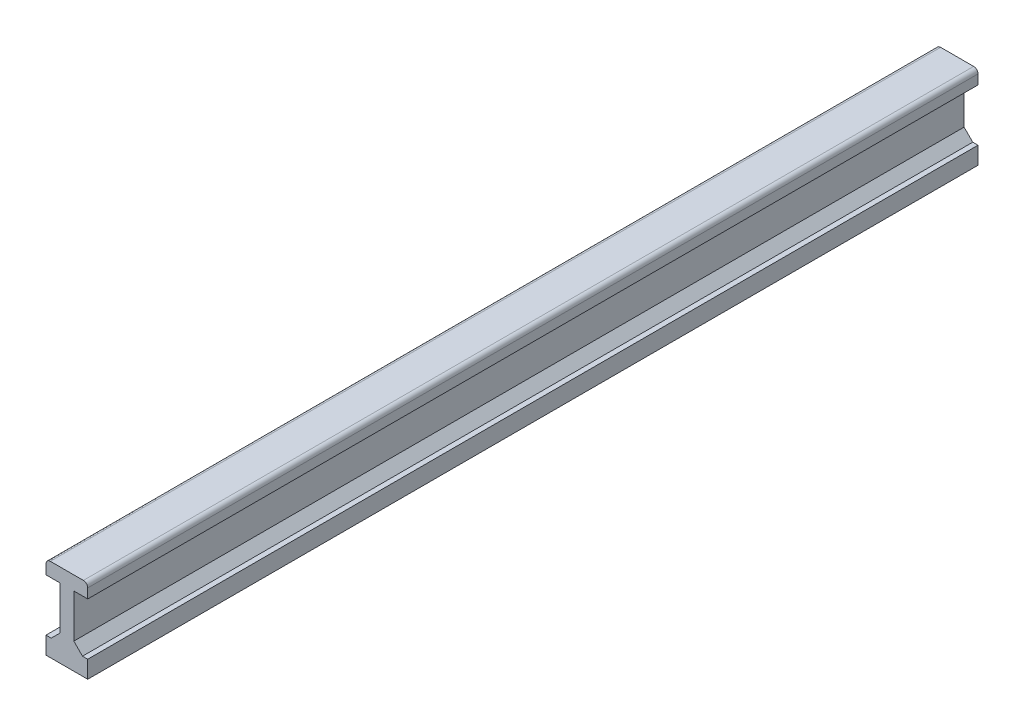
from build123d import *

# Parameters (mm, degrees)
BOSS_EXTRUDE2_DEPTH = 812.8
FILLET1_R           = 7.9248
CHAMFER1_SIZE       = 15.875


with BuildPart() as part:
    # Sketch2 → Boss-Extrude2 (new, symmetric)
    with BuildSketch(Plane.XY):
        Polygon((-736.6, 127), (-736.6, 31.75), (-711.2, 31.75), (-711.2, 0), (-787.4, 0), (-787.4, 31.75), (-762, 31.75), (-762, 127), (-787.4, 127), (-787.4, 152.4), (-711.2, 152.4), (-711.2, 127), align=None)
    extrude(amount=BOSS_EXTRUDE2_DEPTH, both=True)

    # Fillet1
    fillet1_edges = [part.edges().sort_by_distance(p)[0] for p in [
        (-787.4, 152.4, 0),
        (-711.2, 152.4, 0),
    ]]
    fillet(fillet1_edges, radius=FILLET1_R)

    # Chamfer1
    chamfer1_edges = [part.edges().sort_by_distance(p)[0] for p in [
        (-736.6, 31.75, 0),
        (-762, 31.75, 0),
    ]]
    chamfer(chamfer1_edges, length=CHAMFER1_SIZE)


solid = part.part
